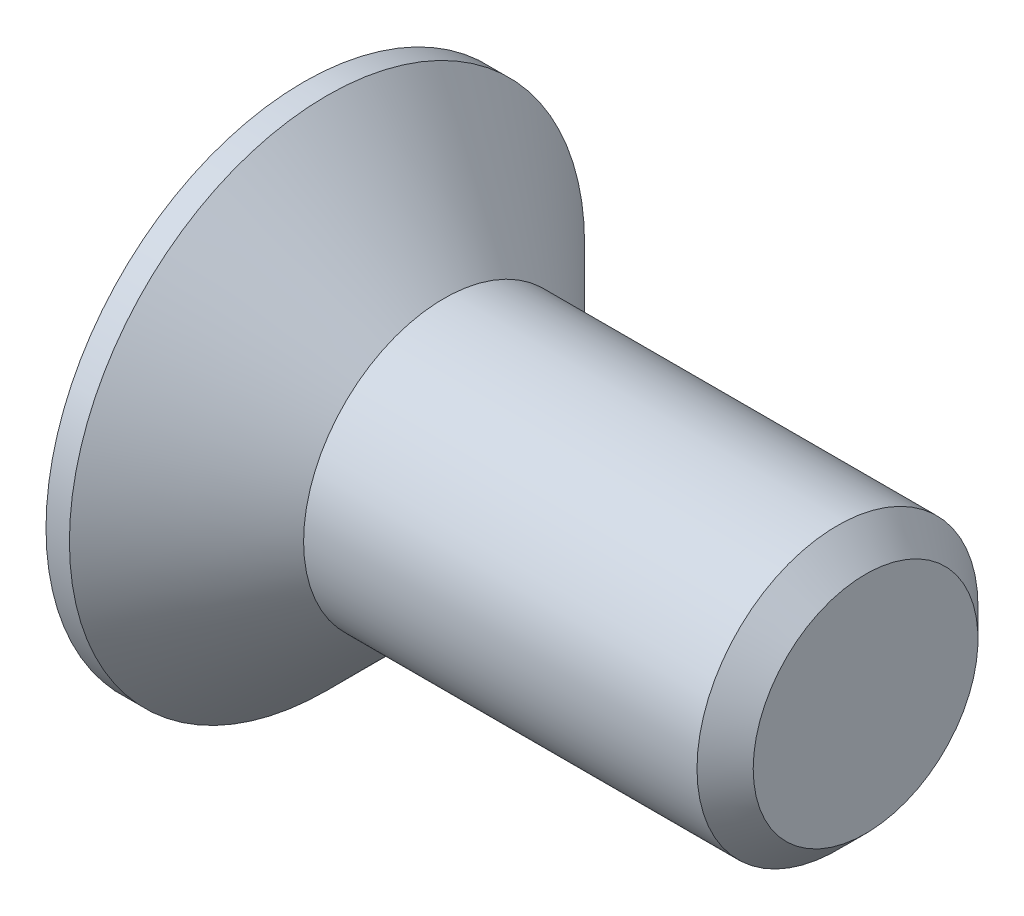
from build123d import *

# Parameters (mm, degrees)
CHAMFER1_SIZE      = 0.6
CUT_EXTRUDE1_DEPTH = 2.5


with BuildPart() as part:
    # Sketch1 → Revolve1 (revolve)
    with BuildSketch(Plane.XY, mode=Mode.PRIVATE) as revolve1_sk:
        Polygon((-3, 5.5), (-3, 0), (9, 0), (9, 3), (0, 3), (-2.5, 5.5), align=None)
    revolve(revolve1_sk.sketch.rotate(Axis((-3, 0, 0), (1, 0, 0)), 90), axis=Axis((-3, 0, 0), (1, 0, 0)))

    # Chamfer1
    chamfer1_edges = [part.edges().sort_by_distance(p)[0] for p in [
        (9, 0, -3),
    ]]
    chamfer(chamfer1_edges, length=CHAMFER1_SIZE)

    # Sketch2 → Cut-Extrude1 (cut)
    with BuildSketch(Plane.ZY.offset(3)):
        Polygon((-0.825, 3.3), (0.825, 3.3), (0.825, 0.825), (3.3, 0.825), (3.3, -0.825), (0.825, -0.825), (0.825, -3.3), (-0.825, -3.3), (-0.825, -0.825), (-3.3, -0.825), (-3.3, 0.825), (-0.825, 0.825), align=None)
    extrude(amount=-CUT_EXTRUDE1_DEPTH, mode=Mode.SUBTRACT)


solid = part.part
